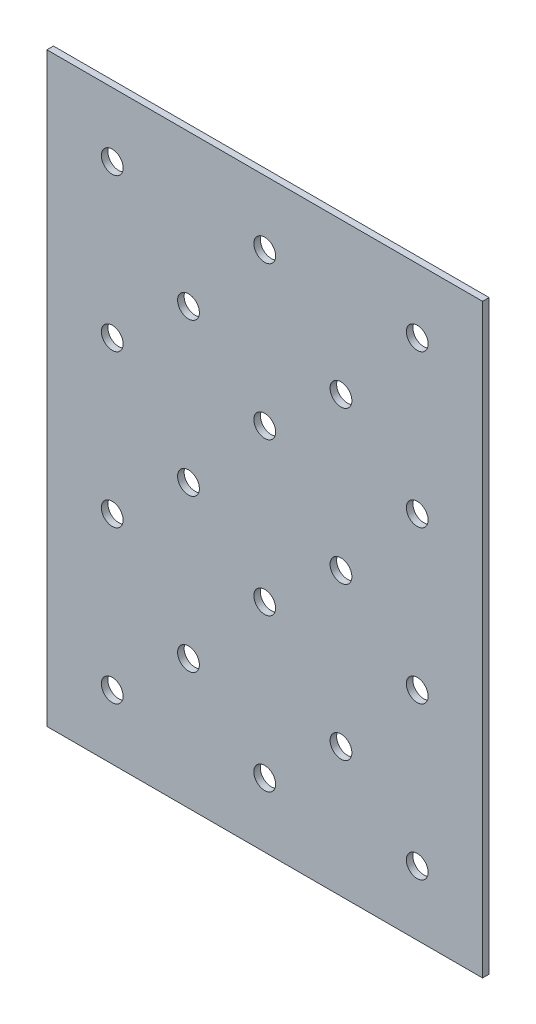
from build123d import *

# Parameters (mm, degrees)
ESQUISSE1_W             = 200
ESQUISSE1_H             = 269
EXTRUSION1_DEPTH        = 3
ESQUISSE3_R             = 5
ENL_V_MAT_EXTRU_2_DEPTH = 3


with BuildPart() as part:
    # Esquisse1 → Extrusion1 (new body)
    with BuildSketch(Plane.XY):
        with Locations((100, 134.5)):
            Rectangle(ESQUISSE1_W, ESQUISSE1_H)
    extrude(amount=EXTRUSION1_DEPTH)

    # Esquisse3 → Enl_v. mat.-Extru.2 (cut)
    with BuildSketch(Plane.XY.offset(3)):
        with Locations((170, 239.5)):
            Circle(ESQUISSE3_R)
        with Locations((135, 199.5)):
            Circle(ESQUISSE3_R)
        with Locations((100, 239.5)):
            Circle(ESQUISSE3_R)
        with Locations((30, 239.5)):
            Circle(ESQUISSE3_R)
        with Locations((170, 169.5)):
            Circle(ESQUISSE3_R)
        with Locations((100, 169.5)):
            Circle(ESQUISSE3_R)
        with Locations((30, 169.5)):
            Circle(ESQUISSE3_R)
        with Locations((170, 99.5)):
            Circle(ESQUISSE3_R)
        with Locations((100, 99.5)):
            Circle(ESQUISSE3_R)
        with Locations((30, 99.5)):
            Circle(ESQUISSE3_R)
        with Locations((170, 29.5)):
            Circle(ESQUISSE3_R)
        with Locations((100, 29.5)):
            Circle(ESQUISSE3_R)
        with Locations((30, 29.5)):
            Circle(ESQUISSE3_R)
        with Locations((65, 199.5)):
            Circle(ESQUISSE3_R)
        with Locations((135, 129.5)):
            Circle(ESQUISSE3_R)
        with Locations((65, 129.5)):
            Circle(ESQUISSE3_R)
        with Locations((135, 59.5)):
            Circle(ESQUISSE3_R)
        with Locations((65, 59.5)):
            Circle(ESQUISSE3_R)
    extrude(amount=-ENL_V_MAT_EXTRU_2_DEPTH, mode=Mode.SUBTRACT)


solid = part.part
